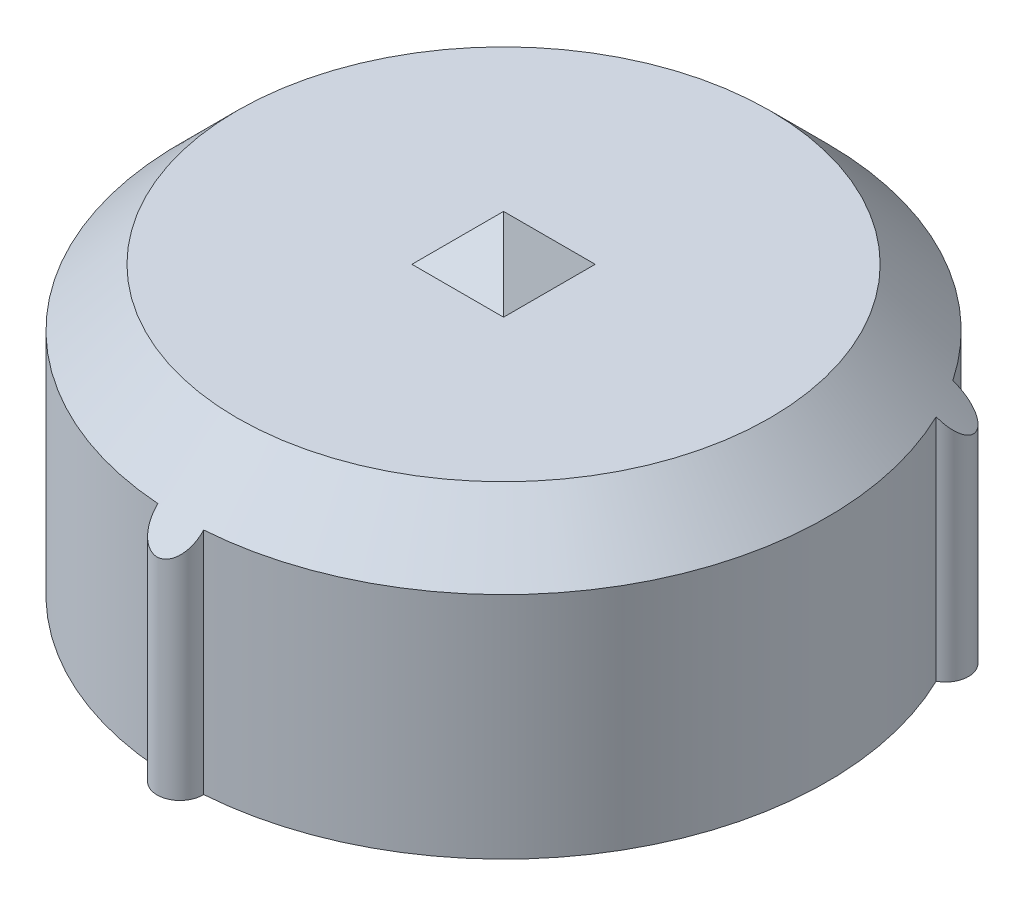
ISO-10303-21;
HEADER;
FILE_DESCRIPTION(('STEP AP214'),'2;1');
FILE_NAME('part.step','',(''),(''),'','','');
FILE_SCHEMA(('AUTOMOTIVE_DESIGN { 1 0 10303 214 1 1 1 1 }'));
ENDSEC;
DATA;
#1=APPLICATION_CONTEXT('core data for automotive mechanical design processes');
#2=APPLICATION_PROTOCOL_DEFINITION('international standard','automotive_design',2000,#1);
#3=PRODUCT_CONTEXT('',#1,'mechanical');
#4=PRODUCT('Part','Part','',(#3));
#5=PRODUCT_RELATED_PRODUCT_CATEGORY('part','',(#4));
#6=PRODUCT_DEFINITION_FORMATION('','',#4);
#7=PRODUCT_DEFINITION_CONTEXT('part definition',#1,'design');
#8=PRODUCT_DEFINITION('design','',#6,#7);
#9=PRODUCT_DEFINITION_SHAPE('','',#8);
#10=(LENGTH_UNIT() NAMED_UNIT(*) SI_UNIT(.MILLI.,.METRE.));
#11=(NAMED_UNIT(*) PLANE_ANGLE_UNIT() SI_UNIT($,.RADIAN.));
#12=(NAMED_UNIT(*) SI_UNIT($,.STERADIAN.) SOLID_ANGLE_UNIT());
#13=UNCERTAINTY_MEASURE_WITH_UNIT(LENGTH_MEASURE(1.E-05),#10,'distance_accuracy_value','');
#14=(GEOMETRIC_REPRESENTATION_CONTEXT(3) GLOBAL_UNCERTAINTY_ASSIGNED_CONTEXT((#13)) GLOBAL_UNIT_ASSIGNED_CONTEXT((#10,
#11,#12)) REPRESENTATION_CONTEXT('',''));
#15=CARTESIAN_POINT('',(0.,0.,0.));
#16=DIRECTION('',(0.,0.,1.));
#17=DIRECTION('',(1.,0.,0.));
#18=AXIS2_PLACEMENT_3D('',#15,#16,#17);
#19=CARTESIAN_POINT('',(6.05,5.,0.));
#20=DIRECTION('',(0.,-1.,0.));
#21=DIRECTION('',(0.,0.,-1.));
#22=AXIS2_PLACEMENT_3D('',#19,#20,#21);
#23=PLANE('',#22);
#24=DIRECTION('',(0.,0.,-1.));
#25=VECTOR('',#24,1.);
#26=CARTESIAN_POINT('',(0.8,5.,0.));
#27=LINE('',#26,#25);
#28=CARTESIAN_POINT('',(0.8,5.,0.799999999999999));
#29=VERTEX_POINT('',#28);
#30=CARTESIAN_POINT('',(0.8,5.,-0.800000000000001));
#31=VERTEX_POINT('',#30);
#32=EDGE_CURVE('E111',#29,#31,#27,.T.);
#33=ORIENTED_EDGE('',*,*,#32,.F.);
#34=DIRECTION('',(1.,0.,0.));
#35=VECTOR('',#34,1.);
#36=CARTESIAN_POINT('',(6.05,5.,0.799999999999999));
#37=LINE('',#36,#35);
#38=CARTESIAN_POINT('',(-0.799999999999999,5.,0.799999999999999));
#39=VERTEX_POINT('',#38);
#40=EDGE_CURVE('E107',#39,#29,#37,.T.);
#41=ORIENTED_EDGE('',*,*,#40,.F.);
#42=DIRECTION('',(0.,0.,1.));
#43=VECTOR('',#42,1.);
#44=CARTESIAN_POINT('',(-0.8,5.,0.));
#45=LINE('',#44,#43);
#46=CARTESIAN_POINT('',(-0.800000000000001,5.,-0.800000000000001));
#47=VERTEX_POINT('',#46);
#48=EDGE_CURVE('E110',#47,#39,#45,.T.);
#49=ORIENTED_EDGE('',*,*,#48,.F.);
#50=DIRECTION('',(-1.,0.,0.));
#51=VECTOR('',#50,1.);
#52=CARTESIAN_POINT('',(6.05,5.,-0.800000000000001));
#53=LINE('',#52,#51);
#54=EDGE_CURVE('E61',#31,#47,#53,.T.);
#55=ORIENTED_EDGE('',*,*,#54,.F.);
#56=EDGE_LOOP('',(#33,#41,#49,#55));
#57=FACE_BOUND('',#56,.T.);
#58=CARTESIAN_POINT('',(0.,5.,0.));
#59=DIRECTION('',(0.,-1.,0.));
#60=DIRECTION('',(0.,0.,-1.));
#61=AXIS2_PLACEMENT_3D('',#58,#59,#60);
#62=CIRCLE('',#61,4.65);
#63=CARTESIAN_POINT('',(0.,5.,-4.65));
#64=VERTEX_POINT('',#63);
#65=EDGE_CURVE('E250',#64,#64,#62,.T.);
#66=ORIENTED_EDGE('',*,*,#65,.F.);
#67=EDGE_LOOP('',(#66));
#68=FACE_BOUND('',#67,.T.);
#69=ADVANCED_FACE('F37',(#57,#68),#23,.F.);
#70=CARTESIAN_POINT('',(0.8,5.,0.));
#71=DIRECTION('',(0.707106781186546,0.707106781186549,0.));
#72=DIRECTION('',(-0.707106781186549,0.707106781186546,0.));
#73=AXIS2_PLACEMENT_3D('',#70,#71,#72);
#74=PLANE('',#73);
#75=DIRECTION('',(0.577350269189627,-0.577350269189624,0.577350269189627));
#76=VECTOR('',#75,1.);
#77=CARTESIAN_POINT('',(0.533333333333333,5.26666666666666,0.533333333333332));
#78=LINE('',#77,#76);
#79=CARTESIAN_POINT('',(0.,5.8,0.));
#80=VERTEX_POINT('',#79);
#81=EDGE_CURVE('E74',#80,#29,#78,.T.);
#82=ORIENTED_EDGE('',*,*,#81,.T.);
#83=ORIENTED_EDGE('',*,*,#32,.T.);
#84=DIRECTION('',(0.577350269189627,-0.577350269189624,-0.577350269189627));
#85=VECTOR('',#84,1.);
#86=CARTESIAN_POINT('',(2.55000000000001,3.25,-2.55));
#87=LINE('',#86,#85);
#88=EDGE_CURVE('E113',#80,#31,#87,.T.);
#89=ORIENTED_EDGE('',*,*,#88,.F.);
#90=EDGE_LOOP('',(#82,#83,#89));
#91=FACE_BOUND('',#90,.T.);
#92=ADVANCED_FACE('F140',(#91),#74,.T.);
#93=CARTESIAN_POINT('',(6.05,5.,-0.800000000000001));
#94=DIRECTION('',(0.,0.707106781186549,-0.707106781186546));
#95=DIRECTION('',(0.,0.707106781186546,0.707106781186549));
#96=AXIS2_PLACEMENT_3D('',#93,#94,#95);
#97=PLANE('',#96);
#98=ORIENTED_EDGE('',*,*,#88,.T.);
#99=ORIENTED_EDGE('',*,*,#54,.T.);
#100=DIRECTION('',(-0.577350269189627,-0.577350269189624,-0.577350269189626));
#101=VECTOR('',#100,1.);
#102=CARTESIAN_POINT('',(-0.533333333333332,5.26666666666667,-0.533333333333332));
#103=LINE('',#102,#101);
#104=EDGE_CURVE('E121',#80,#47,#103,.T.);
#105=ORIENTED_EDGE('',*,*,#104,.F.);
#106=EDGE_LOOP('',(#98,#99,#105));
#107=FACE_BOUND('',#106,.T.);
#108=ADVANCED_FACE('F138',(#107),#97,.T.);
#109=CARTESIAN_POINT('',(-0.8,5.,0.));
#110=DIRECTION('',(-0.707106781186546,0.707106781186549,0.));
#111=DIRECTION('',(-0.707106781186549,-0.707106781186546,0.));
#112=AXIS2_PLACEMENT_3D('',#109,#110,#111);
#113=PLANE('',#112);
#114=ORIENTED_EDGE('',*,*,#104,.T.);
#115=ORIENTED_EDGE('',*,*,#48,.T.);
#116=DIRECTION('',(-0.577350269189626,-0.577350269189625,0.577350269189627));
#117=VECTOR('',#116,1.);
#118=CARTESIAN_POINT('',(1.48333333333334,7.28333333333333,-1.48333333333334));
#119=LINE('',#118,#117);
#120=EDGE_CURVE('E119',#80,#39,#119,.T.);
#121=ORIENTED_EDGE('',*,*,#120,.F.);
#122=EDGE_LOOP('',(#114,#115,#121));
#123=FACE_BOUND('',#122,.T.);
#124=ADVANCED_FACE('F118',(#123),#113,.T.);
#125=CARTESIAN_POINT('',(6.05,5.,0.799999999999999));
#126=DIRECTION('',(0.,0.707106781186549,0.707106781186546));
#127=DIRECTION('',(0.,-0.707106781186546,0.707106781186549));
#128=AXIS2_PLACEMENT_3D('',#125,#126,#127);
#129=PLANE('',#128);
#130=ORIENTED_EDGE('',*,*,#120,.T.);
#131=ORIENTED_EDGE('',*,*,#40,.T.);
#132=ORIENTED_EDGE('',*,*,#81,.F.);
#133=EDGE_LOOP('',(#130,#131,#132));
#134=FACE_BOUND('',#133,.T.);
#135=ADVANCED_FACE('F39',(#134),#129,.T.);
#136=CARTESIAN_POINT('',(0.,1.,0.));
#137=DIRECTION('',(0.,-1.,0.));
#138=DIRECTION('',(0.,0.,-1.));
#139=AXIS2_PLACEMENT_3D('',#136,#137,#138);
#140=CONICAL_SURFACE('',#139,8.65000000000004,0.785398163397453);
#141=ORIENTED_EDGE('',*,*,#65,.T.);
#142=EDGE_LOOP('',(#141));
#143=FACE_BOUND('',#142,.T.);
#144=CARTESIAN_POINT('',(-0.399742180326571,4.00020000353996,5.6356407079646));
#145=CARTESIAN_POINT('',(-0.400281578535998,3.98502719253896,5.65081283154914));
#146=CARTESIAN_POINT('',(-0.399968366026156,3.96987927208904,5.66602162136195));
#147=CARTESIAN_POINT('',(-0.397588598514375,3.9396908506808,5.6964515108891));
#148=CARTESIAN_POINT('',(-0.395519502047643,3.92465053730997,5.71167259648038));
#149=CARTESIAN_POINT('',(-0.3865573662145,3.87959302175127,5.75745093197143));
#150=CARTESIAN_POINT('',(-0.376898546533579,3.84989716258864,5.78786525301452));
#151=CARTESIAN_POINT('',(-0.353673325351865,3.80104808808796,5.83825900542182));
#152=CARTESIAN_POINT('',(-0.34210410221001,3.78137189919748,5.85866688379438));
#153=CARTESIAN_POINT('',(-0.314743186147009,3.74361875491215,5.89800767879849));
#154=CARTESIAN_POINT('',(-0.298966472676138,3.72553642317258,5.91694552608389));
#155=CARTESIAN_POINT('',(-0.267315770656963,3.6958371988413,5.94817608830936));
#156=CARTESIAN_POINT('',(-0.252402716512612,3.68371865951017,5.96096342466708));
#157=CARTESIAN_POINT('',(-0.219957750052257,3.66128680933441,5.98469561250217));
#158=CARTESIAN_POINT('',(-0.202428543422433,3.65097165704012,5.99564234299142));
#159=CARTESIAN_POINT('',(-0.168542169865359,3.63450034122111,6.01315766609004));
#160=CARTESIAN_POINT('',(-0.152616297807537,3.6279255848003,6.02016360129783));
#161=CARTESIAN_POINT('',(-0.119390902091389,3.61666761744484,6.03217414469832));
#162=CARTESIAN_POINT('',(-0.102092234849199,3.6119832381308,6.03717998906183));
#163=CARTESIAN_POINT('',(-0.0664171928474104,3.60479018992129,6.04487153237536));
#164=CARTESIAN_POINT('',(-0.0480345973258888,3.60229572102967,6.04754208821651));
#165=CARTESIAN_POINT('',(-0.0109101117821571,3.59973518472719,6.0502834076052));
#166=CARTESIAN_POINT('',(0.0078316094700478,3.59966800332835,6.05035536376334));
#167=CARTESIAN_POINT('',(0.0430114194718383,3.60184024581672,6.04802970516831));
#168=CARTESIAN_POINT('',(0.0594832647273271,3.60383613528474,6.04589283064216));
#169=CARTESIAN_POINT('',(0.0917237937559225,3.60963768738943,6.03968748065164));
#170=CARTESIAN_POINT('',(0.107492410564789,3.61344352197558,6.0356188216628));
#171=CARTESIAN_POINT('',(0.138454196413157,3.6227932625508,6.02563705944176));
#172=CARTESIAN_POINT('',(0.153615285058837,3.62838650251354,6.01967163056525));
#173=CARTESIAN_POINT('',(0.182613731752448,3.6410008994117,6.0062416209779));
#174=CARTESIAN_POINT('',(0.196450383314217,3.64802281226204,5.99877624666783));
#175=CARTESIAN_POINT('',(0.229023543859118,3.66690910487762,5.97873898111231));
#176=CARTESIAN_POINT('',(0.246907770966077,3.67947632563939,5.96543999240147));
#177=CARTESIAN_POINT('',(0.279496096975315,3.70647785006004,5.9369709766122));
#178=CARTESIAN_POINT('',(0.294193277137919,3.72091610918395,5.92179698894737));
#179=CARTESIAN_POINT('',(0.32521968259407,3.75650643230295,5.88454416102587));
#180=CARTESIAN_POINT('',(0.340264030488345,3.77821746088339,5.86193170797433));
#181=CARTESIAN_POINT('',(0.365164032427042,3.82317330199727,5.81538944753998));
#182=CARTESIAN_POINT('',(0.37500855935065,3.84642128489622,5.79145693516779));
#183=CARTESIAN_POINT('',(0.389109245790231,3.8913830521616,5.74546175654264));
#184=CARTESIAN_POINT('',(0.39383132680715,3.91301294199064,5.72345596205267));
#185=CARTESIAN_POINT('',(0.399519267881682,3.95649040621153,5.67947562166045));
#186=CARTESIAN_POINT('',(0.40051113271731,3.97833540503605,5.65750193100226));
#187=CARTESIAN_POINT('',(0.399742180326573,4.00020000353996,5.6356407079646));
#188=B_SPLINE_CURVE_WITH_KNOTS('',3,(#144,#145,#146,#147,#148,#149,#150,#151,#152,#153,#154,
#155,#156,#157,#158,#159,#160,#161,#162,#163,#164,#165,#166,#167,#168,#169,#170,#171,#172,#173,
#174,#175,#176,#177,#178,#179,#180,#181,#182,#183,#184,#185,#186,#187),.UNSPECIFIED.,.F.,.F.,(4,
2,2,2,2,2,2,2,2,2,2,2,2,2,2,2,2,2,2,2,2,4),(0.,0.0643461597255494,0.128785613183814,
0.258746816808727,0.350316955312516,0.441565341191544,0.510573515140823,0.5795108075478,
0.635087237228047,0.690629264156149,0.746528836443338,0.802402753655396,0.852359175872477,
0.902320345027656,0.953800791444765,1.00530854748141,1.08163954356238,1.15813462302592,
1.26188985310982,1.36586621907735,1.45928542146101,1.55205214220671),.UNSPECIFIED.);
#189=CARTESIAN_POINT('',(-0.399749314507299,4.00000000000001,5.6358407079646));
#190=VERTEX_POINT('',#189);
#191=CARTESIAN_POINT('',(0.3997493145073,4.00000000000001,5.6358407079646));
#192=VERTEX_POINT('',#191);
#193=EDGE_CURVE('E130',#190,#192,#188,.T.);
#194=ORIENTED_EDGE('',*,*,#193,.T.);
#195=CARTESIAN_POINT('',(0.,4.00000000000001,0.));
#196=DIRECTION('',(0.,-1.,0.));
#197=DIRECTION('',(0.,0.,-1.));
#198=AXIS2_PLACEMENT_3D('',#195,#196,#197);
#199=CIRCLE('',#198,5.65);
#200=CARTESIAN_POINT('',(5.0806558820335,4.00000000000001,-2.47172729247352));
#201=VERTEX_POINT('',#200);
#202=EDGE_CURVE('E214',#192,#201,#199,.F.);
#203=ORIENTED_EDGE('',*,*,#202,.T.);
#204=CARTESIAN_POINT('',(4.61783399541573,4.38224711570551,-2.53472476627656));
#205=CARTESIAN_POINT('',(4.6335834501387,4.37562432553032,-2.5197937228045));
#206=CARTESIAN_POINT('',(4.65007364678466,4.36740282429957,-2.50658664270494));
#207=CARTESIAN_POINT('',(4.68372834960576,4.34859119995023,-2.48353587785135));
#208=CARTESIAN_POINT('',(4.7008833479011,4.33802836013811,-2.47365651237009));
#209=CARTESIAN_POINT('',(4.73575420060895,4.31497422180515,-2.45670107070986));
#210=CARTESIAN_POINT('',(4.75347457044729,4.30245109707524,-2.44967975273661));
#211=CARTESIAN_POINT('',(4.78889343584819,4.27609345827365,-2.43834844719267));
#212=CARTESIAN_POINT('',(4.80659158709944,4.26225410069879,-2.43404895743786));
#213=CARTESIAN_POINT('',(4.85015756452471,4.22677859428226,-2.42642820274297));
#214=CARTESIAN_POINT('',(4.87584458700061,4.20460389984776,-2.42458127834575));
#215=CARTESIAN_POINT('',(4.92606031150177,4.15915558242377,-2.42557511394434));
#216=CARTESIAN_POINT('',(4.95058934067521,4.13588227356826,-2.42841454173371));
#217=CARTESIAN_POINT('',(4.99302085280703,4.09389319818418,-2.43722927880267));
#218=CARTESIAN_POINT('',(5.0112056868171,4.07528513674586,-2.44238978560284));
#219=CARTESIAN_POINT('',(5.04654953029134,4.03792194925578,-2.45514997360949));
#220=CARTESIAN_POINT('',(5.06370807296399,4.01916676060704,-2.46275075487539));
#221=CARTESIAN_POINT('',(5.10724371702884,3.96993138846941,-2.48580902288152));
#222=CARTESIAN_POINT('',(5.13265210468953,3.93947593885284,-2.50320413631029));
#223=CARTESIAN_POINT('',(5.17945502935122,3.87948206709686,-2.54404974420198));
#224=CARTESIAN_POINT('',(5.20084890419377,3.84994379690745,-2.56750123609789));
#225=CARTESIAN_POINT('',(5.23279848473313,3.80123796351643,-2.61265235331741));
#226=CARTESIAN_POINT('',(5.24469418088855,3.78156330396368,-2.63285944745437));
#227=CARTESIAN_POINT('',(5.26511713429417,3.74378108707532,-2.67622529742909));
#228=CARTESIAN_POINT('',(5.27365052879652,3.72567072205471,-2.6993785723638));
#229=CARTESIAN_POINT('',(5.28489751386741,3.69593591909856,-2.74243307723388));
#230=CARTESIAN_POINT('',(5.28852371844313,3.68380802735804,-2.76174630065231));
#231=CARTESIAN_POINT('',(5.29286915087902,3.66136056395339,-2.8017165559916));
#232=CARTESIAN_POINT('',(5.29359205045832,3.65103872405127,-2.82237185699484));
#233=CARTESIAN_POINT('',(5.29183066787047,3.63455475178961,-2.86047987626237));
#234=CARTESIAN_POINT('',(5.2899407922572,3.6279741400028,-2.87777746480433));
#235=CARTESIAN_POINT('',(5.28374041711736,3.61670431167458,-2.91256305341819));
#236=CARTESIAN_POINT('',(5.27943138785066,3.61201394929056,-2.93005093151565));
#237=CARTESIAN_POINT('',(5.26826415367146,3.60480922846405,-2.96480113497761));
#238=CARTESIAN_POINT('',(5.26138972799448,3.60230906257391,-2.98206128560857));
#239=CARTESIAN_POINT('',(5.2452081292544,3.59973791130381,-3.01559399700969));
#240=CARTESIAN_POINT('',(5.23590204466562,3.59966584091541,-3.0318669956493));
#241=CARTESIAN_POINT('',(5.21630250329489,3.60182986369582,-3.06118067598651));
#242=CARTESIAN_POINT('',(5.20621840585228,3.60382199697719,-3.07438112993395));
#243=CARTESIAN_POINT('',(5.18472816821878,3.60961660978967,-3.09920742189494));
#244=CARTESIAN_POINT('',(5.17332191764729,3.61341924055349,-3.11083312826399));
#245=CARTESIAN_POINT('',(5.14920096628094,3.622762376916,-3.13266232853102));
#246=CARTESIAN_POINT('',(5.13645712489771,3.62835196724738,-3.14281217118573));
#247=CARTESIAN_POINT('',(5.11033253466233,3.64095927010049,-3.16121620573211));
#248=CARTESIAN_POINT('',(5.09695145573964,3.64797772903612,-3.16946940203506));
#249=CARTESIAN_POINT('',(5.0633219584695,3.666853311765,-3.18766526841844));
#250=CARTESIAN_POINT('',(5.04286986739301,3.67941286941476,-3.19650730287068));
#251=CARTESIAN_POINT('',(5.00193108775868,3.70640110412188,-3.21050467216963));
#252=CARTESIAN_POINT('',(4.98144442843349,3.72083403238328,-3.21565144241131));
#253=CARTESIAN_POINT('',(4.93366086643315,3.75642320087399,-3.22391061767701));
#254=CARTESIAN_POINT('',(4.90654436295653,3.77813990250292,-3.22564032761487));
#255=CARTESIAN_POINT('',(4.85379731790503,3.82308133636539,-3.22394530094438));
#256=CARTESIAN_POINT('',(4.82816815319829,3.84630742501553,-3.22051586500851));
#257=CARTESIAN_POINT('',(4.78133456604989,3.8912126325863,-3.20975637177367));
#258=CARTESIAN_POINT('',(4.75994559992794,3.91280736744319,-3.20286062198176));
#259=CARTESIAN_POINT('',(4.71894329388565,3.95633948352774,-3.18580661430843));
#260=CARTESIAN_POINT('',(4.6993278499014,3.97827642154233,-3.17565228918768));
#261=CARTESIAN_POINT('',(4.67002930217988,4.01282710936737,-3.15730015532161));
#262=CARTESIAN_POINT('',(4.65967889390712,4.02542579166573,-3.15011572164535));
#263=CARTESIAN_POINT('',(4.63968303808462,4.05057729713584,-3.13478478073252));
#264=CARTESIAN_POINT('',(4.63003704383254,4.06313014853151,-3.12663903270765));
#265=CARTESIAN_POINT('',(4.6207607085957,4.07563971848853,-3.11802229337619));
#266=B_SPLINE_CURVE_WITH_KNOTS('',3,(#204,#205,#206,#207,#208,#209,#210,#211,#212,#213,#214,
#215,#216,#217,#218,#219,#220,#221,#222,#223,#224,#225,#226,#227,#228,#229,#230,#231,#232,#233,
#234,#235,#236,#237,#238,#239,#240,#241,#242,#243,#244,#245,#246,#247,#248,#249,#250,#251,#252,
#253,#254,#255,#256,#257,#258,#259,#260,#261,#262,#263,#264,#265),.UNSPECIFIED.,.F.,.F.,(4,2,2,
2,2,2,2,2,2,2,2,2,2,2,2,2,2,2,2,2,2,2,2,2,2,2,2,2,2,2,4),(0.,0.0677177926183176,
0.134684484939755,0.202879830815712,0.271336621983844,0.372842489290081,0.474319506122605,
0.553761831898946,0.633240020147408,0.762571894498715,0.891925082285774,0.983458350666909,
1.07482375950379,1.14386139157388,1.21281168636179,1.26839927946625,1.32395312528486,
1.37986435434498,1.43575059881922,1.48571035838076,1.53567429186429,1.58714942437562,
1.63865151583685,1.71495744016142,1.79143965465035,1.8952323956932,1.9991197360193,
2.09239331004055,2.1855547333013,2.23897260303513,2.29234856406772),.UNSPECIFIED.);
#267=CARTESIAN_POINT('',(4.6809065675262,4.00000000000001,-3.164113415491));
#268=VERTEX_POINT('',#267);
#269=EDGE_CURVE('E52',#201,#268,#266,.T.);
#270=ORIENTED_EDGE('',*,*,#269,.T.);
#271=CARTESIAN_POINT('',(0.,4.00000000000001,0.));
#272=DIRECTION('',(0.,-1.,0.));
#273=DIRECTION('',(0.,0.,-1.));
#274=AXIS2_PLACEMENT_3D('',#271,#272,#273);
#275=CIRCLE('',#274,5.65);
#276=CARTESIAN_POINT('',(-4.68090656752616,4.00000000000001,-3.16411341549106));
#277=VERTEX_POINT('',#276);
#278=EDGE_CURVE('E11',#268,#277,#275,.F.);
#279=ORIENTED_EDGE('',*,*,#278,.T.);
#280=CARTESIAN_POINT('',(-4.62076070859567,4.07563971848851,-3.11802229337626));
#281=CARTESIAN_POINT('',(-4.63234286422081,4.0600228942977,-3.12877641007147));
#282=CARTESIAN_POINT('',(-4.64449392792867,4.04434471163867,-3.13879697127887));
#283=CARTESIAN_POINT('',(-4.66987007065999,4.01294364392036,-3.15732790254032));
#284=CARTESIAN_POINT('',(-4.68309587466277,3.99722073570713,-3.16583724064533));
#285=CARTESIAN_POINT('',(-4.72444917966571,3.94992318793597,-3.18911706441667));
#286=CARTESIAN_POINT('',(-4.75409489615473,3.91843222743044,-3.20149318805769));
#287=CARTESIAN_POINT('',(-4.81010151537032,3.86319936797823,-3.21714873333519));
#288=CARTESIAN_POINT('',(-4.83585238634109,3.83921442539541,-3.22178945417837));
#289=CARTESIAN_POINT('',(-4.88897110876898,3.79269263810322,-3.22586133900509));
#290=CARTESIAN_POINT('',(-4.91633382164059,3.77015162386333,-3.22530825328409));
#291=CARTESIAN_POINT('',(-4.96443831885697,3.73323426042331,-3.21910582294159));
#292=CARTESIAN_POINT('',(-4.98494488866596,3.71831061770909,-3.2148911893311));
#293=CARTESIAN_POINT('',(-5.02608659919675,3.69018267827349,-3.20283272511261));
#294=CARTESIAN_POINT('',(-5.04672154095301,3.67697619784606,-3.19499356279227));
#295=CARTESIAN_POINT('',(-5.08305438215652,3.65556041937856,-3.1774343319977));
#296=CARTESIAN_POINT('',(-5.09885251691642,3.64688850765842,-3.16849080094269));
#297=CARTESIAN_POINT('',(-5.12968885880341,3.63140845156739,-3.14801814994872));
#298=CARTESIAN_POINT('',(-5.14472740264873,3.6245994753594,-3.13649018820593));
#299=CARTESIAN_POINT('',(-5.17360324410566,3.61322093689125,-3.11076753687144));
#300=CARTESIAN_POINT('',(-5.18742809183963,3.60867275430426,-3.09654908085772));
#301=CARTESIAN_POINT('',(-5.21303247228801,3.60229706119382,-3.06584257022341));
#302=CARTESIAN_POINT('',(-5.22481428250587,3.60046650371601,-3.04935708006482));
#303=CARTESIAN_POINT('',(-5.24419470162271,3.59974806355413,-3.01732793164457));
#304=CARTESIAN_POINT('',(-5.25215496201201,3.60046263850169,-3.00200947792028));
#305=CARTESIAN_POINT('',(-5.26596780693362,3.60392502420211,-2.9706726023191));
#306=CARTESIAN_POINT('',(-5.27182051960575,3.6066727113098,-2.95465422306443));
#307=CARTESIAN_POINT('',(-5.28122901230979,3.61391570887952,-2.92287330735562));
#308=CARTESIAN_POINT('',(-5.28484554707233,3.61835893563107,-2.90711650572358));
#309=CARTESIAN_POINT('',(-5.29012519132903,3.62875989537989,-2.87578400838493));
#310=CARTESIAN_POINT('',(-5.29178750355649,3.63471824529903,-2.86020838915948));
#311=CARTESIAN_POINT('',(-5.29362471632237,3.65060457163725,-2.82323672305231));
#312=CARTESIAN_POINT('',(-5.29291348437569,3.66115949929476,-2.80206491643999));
#313=CARTESIAN_POINT('',(-5.28844886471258,3.68416643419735,-2.76111788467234));
#314=CARTESIAN_POINT('',(-5.28468928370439,3.69662226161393,-2.74134559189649));
#315=CARTESIAN_POINT('',(-5.27286439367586,3.72755236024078,-2.69678973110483));
#316=CARTESIAN_POINT('',(-5.26375030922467,3.74660347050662,-2.6726866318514));
#317=CARTESIAN_POINT('',(-5.24190971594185,3.78635719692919,-2.62772109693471));
#318=CARTESIAN_POINT('',(-5.2291779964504,3.80706216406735,-2.60686340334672));
#319=CARTESIAN_POINT('',(-5.19650067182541,3.8560369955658,-2.56253677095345));
#320=CARTESIAN_POINT('',(-5.17554012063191,3.8846798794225,-2.54022799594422));
#321=CARTESIAN_POINT('',(-5.1298862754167,3.94281315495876,-2.50126016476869));
#322=CARTESIAN_POINT('',(-5.10518927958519,3.97230436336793,-2.48460676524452));
#323=CARTESIAN_POINT('',(-5.05253238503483,4.03175299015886,-2.45695279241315));
#324=CARTESIAN_POINT('',(-5.02453593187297,4.06171166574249,-2.4460246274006));
#325=CARTESIAN_POINT('',(-4.96614140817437,4.1209644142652,-2.43057843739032));
#326=CARTESIAN_POINT('',(-4.9357446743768,4.1502588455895,-2.42605687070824));
#327=CARTESIAN_POINT('',(-4.88151547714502,4.19955595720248,-2.4245073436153));
#328=CARTESIAN_POINT('',(-4.85808854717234,4.21995691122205,-2.42580554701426));
#329=CARTESIAN_POINT('',(-4.81063678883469,4.25919366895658,-2.43284987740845));
#330=CARTESIAN_POINT('',(-4.78661421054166,4.27803445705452,-2.43858118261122));
#331=CARTESIAN_POINT('',(-4.75308842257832,4.30256806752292,-2.45014900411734));
#332=CARTESIAN_POINT('',(-4.74359148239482,4.30932078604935,-2.45382521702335));
#333=CARTESIAN_POINT('',(-4.72464673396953,4.32235489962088,-2.46202758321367));
#334=CARTESIAN_POINT('',(-4.71519889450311,4.32863664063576,-2.46655310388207));
#335=CARTESIAN_POINT('',(-4.69738414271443,4.34002072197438,-2.47598952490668));
#336=CARTESIAN_POINT('',(-4.68900606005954,4.34517790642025,-2.48081282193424));
#337=CARTESIAN_POINT('',(-4.65901877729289,4.36285016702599,-2.49959741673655));
#338=CARTESIAN_POINT('',(-4.63786764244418,4.37381435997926,-2.51574826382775));
#339=CARTESIAN_POINT('',(-4.61783399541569,4.38224711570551,-2.53472476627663));
#340=B_SPLINE_CURVE_WITH_KNOTS('',3,(#280,#281,#282,#283,#284,#285,#286,#287,#288,#289,#290,
#291,#292,#293,#294,#295,#296,#297,#298,#299,#300,#301,#302,#303,#304,#305,#306,#307,#308,#309,
#310,#311,#312,#313,#314,#315,#316,#317,#318,#319,#320,#321,#322,#323,#324,#325,#326,#327,#328,
#329,#330,#331,#332,#333,#334,#335,#336,#337,#338,#339),.UNSPECIFIED.,.F.,.F.,(4,2,2,2,2,2,2,2,
2,2,2,2,2,2,2,2,2,2,2,2,2,2,2,2,2,2,2,2,2,4),(0.,0.0666070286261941,0.133259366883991,
0.267460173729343,0.37358939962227,0.479396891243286,0.556275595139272,0.633055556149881,
0.693185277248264,0.753288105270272,0.813948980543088,0.874541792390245,0.926113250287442,
0.977681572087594,1.02777898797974,1.07789683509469,1.14850773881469,1.21926246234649,
1.31487967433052,1.41063531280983,1.5357503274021,1.66099011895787,1.78777777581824,
1.91449531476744,2.00749440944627,2.10018390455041,2.13681140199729,2.1734117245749,
2.20624504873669,2.29204333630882),.UNSPECIFIED.);
#341=CARTESIAN_POINT('',(-5.08065588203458,4.00000000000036,-2.47172729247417));
#342=VERTEX_POINT('',#341);
#343=EDGE_CURVE('E219',#277,#342,#340,.T.);
#344=ORIENTED_EDGE('',*,*,#343,.T.);
#345=CARTESIAN_POINT('',(0.,4.00000000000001,0.));
#346=DIRECTION('',(0.,-1.,0.));
#347=DIRECTION('',(0.,0.,-1.));
#348=AXIS2_PLACEMENT_3D('',#345,#346,#347);
#349=CIRCLE('',#348,5.65);
#350=EDGE_CURVE('E84',#342,#190,#349,.F.);
#351=ORIENTED_EDGE('',*,*,#350,.T.);
#352=EDGE_LOOP('',(#194,#203,#270,#279,#344,#351));
#353=FACE_BOUND('',#352,.T.);
#354=ADVANCED_FACE('F236',(#143,#353),#140,.T.);
#355=CARTESIAN_POINT('',(0.,0.,0.));
#356=DIRECTION('',(0.,1.,0.));
#357=DIRECTION('',(0.,0.,1.));
#358=AXIS2_PLACEMENT_3D('',#355,#356,#357);
#359=PLANE('',#358);
#360=CARTESIAN_POINT('',(0.,0.,0.));
#361=DIRECTION('',(0.,1.,0.));
#362=DIRECTION('',(0.,0.,1.));
#363=AXIS2_PLACEMENT_3D('',#360,#361,#362);
#364=CIRCLE('',#363,5.65);
#365=CARTESIAN_POINT('',(0.3997493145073,0.,5.6358407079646));
#366=VERTEX_POINT('',#365);
#367=CARTESIAN_POINT('',(5.08065588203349,0.,-2.47172729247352));
#368=VERTEX_POINT('',#367);
#369=EDGE_CURVE('E155',#366,#368,#364,.T.);
#370=ORIENTED_EDGE('',*,*,#369,.F.);
#371=CARTESIAN_POINT('',(0.,0.,5.65));
#372=DIRECTION('',(0.,1.,0.));
#373=DIRECTION('',(0.,0.,1.));
#374=AXIS2_PLACEMENT_3D('',#371,#372,#373);
#375=CIRCLE('',#374,0.399999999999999);
#376=CARTESIAN_POINT('',(-0.399749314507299,0.,5.6358407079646));
#377=VERTEX_POINT('',#376);
#378=EDGE_CURVE('E147',#377,#366,#375,.T.);
#379=ORIENTED_EDGE('',*,*,#378,.F.);
#380=CARTESIAN_POINT('',(0.,0.,0.));
#381=DIRECTION('',(0.,1.,0.));
#382=DIRECTION('',(0.,0.,1.));
#383=AXIS2_PLACEMENT_3D('',#380,#381,#382);
#384=CIRCLE('',#383,5.65);
#385=CARTESIAN_POINT('',(-5.08065588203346,0.,-2.47172729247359));
#386=VERTEX_POINT('',#385);
#387=EDGE_CURVE('E142',#386,#377,#384,.T.);
#388=ORIENTED_EDGE('',*,*,#387,.F.);
#389=CARTESIAN_POINT('',(-4.89304353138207,0.,-2.82500000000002));
#390=DIRECTION('',(0.,1.,0.));
#391=DIRECTION('',(0.,0.,1.));
#392=AXIS2_PLACEMENT_3D('',#389,#390,#391);
#393=CIRCLE('',#392,0.399999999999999);
#394=CARTESIAN_POINT('',(-4.68090656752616,0.,-3.16411341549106));
#395=VERTEX_POINT('',#394);
#396=EDGE_CURVE('E165',#395,#386,#393,.T.);
#397=ORIENTED_EDGE('',*,*,#396,.F.);
#398=CARTESIAN_POINT('',(0.,0.,0.));
#399=DIRECTION('',(0.,1.,0.));
#400=DIRECTION('',(0.,0.,1.));
#401=AXIS2_PLACEMENT_3D('',#398,#399,#400);
#402=CIRCLE('',#401,5.65);
#403=CARTESIAN_POINT('',(4.6809065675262,0.,-3.164113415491));
#404=VERTEX_POINT('',#403);
#405=EDGE_CURVE('E161',#404,#395,#402,.T.);
#406=ORIENTED_EDGE('',*,*,#405,.F.);
#407=CARTESIAN_POINT('',(4.8930435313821,0.,-2.82499999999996));
#408=DIRECTION('',(0.,1.,0.));
#409=DIRECTION('',(0.,0.,1.));
#410=AXIS2_PLACEMENT_3D('',#407,#408,#409);
#411=CIRCLE('',#410,0.4);
#412=EDGE_CURVE('E158',#368,#404,#411,.T.);
#413=ORIENTED_EDGE('',*,*,#412,.F.);
#414=EDGE_LOOP('',(#370,#379,#388,#397,#406,#413));
#415=FACE_BOUND('',#414,.T.);
#416=ADVANCED_FACE('F193',(#415),#359,.F.);
#417=CARTESIAN_POINT('',(0.,5.,0.));
#418=DIRECTION('',(0.,-1.,0.));
#419=DIRECTION('',(0.,0.,-1.));
#420=AXIS2_PLACEMENT_3D('',#417,#418,#419);
#421=CYLINDRICAL_SURFACE('',#420,5.65);
#422=ORIENTED_EDGE('',*,*,#350,.F.);
#423=DIRECTION('',(0.,-1.,0.));
#424=VECTOR('',#423,1.);
#425=CARTESIAN_POINT('',(-5.08065588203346,5.,-2.47172729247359));
#426=LINE('',#425,#424);
#427=EDGE_CURVE('E169',#342,#386,#426,.T.);
#428=ORIENTED_EDGE('',*,*,#427,.T.);
#429=ORIENTED_EDGE('',*,*,#387,.T.);
#430=DIRECTION('',(0.,-1.,0.));
#431=VECTOR('',#430,1.);
#432=CARTESIAN_POINT('',(-0.399749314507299,5.,5.6358407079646));
#433=LINE('',#432,#431);
#434=EDGE_CURVE('E46',#190,#377,#433,.T.);
#435=ORIENTED_EDGE('',*,*,#434,.F.);
#436=EDGE_LOOP('',(#422,#428,#429,#435));
#437=FACE_BOUND('',#436,.T.);
#438=ADVANCED_FACE('F196',(#437),#421,.T.);
#439=CARTESIAN_POINT('',(0.,5.,0.));
#440=DIRECTION('',(0.,-1.,0.));
#441=DIRECTION('',(0.,0.,-1.));
#442=AXIS2_PLACEMENT_3D('',#439,#440,#441);
#443=CYLINDRICAL_SURFACE('',#442,5.65);
#444=ORIENTED_EDGE('',*,*,#278,.F.);
#445=DIRECTION('',(0.,-1.,0.));
#446=VECTOR('',#445,1.);
#447=CARTESIAN_POINT('',(4.6809065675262,5.,-3.164113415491));
#448=LINE('',#447,#446);
#449=EDGE_CURVE('E175',#268,#404,#448,.T.);
#450=ORIENTED_EDGE('',*,*,#449,.T.);
#451=ORIENTED_EDGE('',*,*,#405,.T.);
#452=DIRECTION('',(0.,-1.,0.));
#453=VECTOR('',#452,1.);
#454=CARTESIAN_POINT('',(-4.68090656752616,5.,-3.16411341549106));
#455=LINE('',#454,#453);
#456=EDGE_CURVE('E172',#277,#395,#455,.T.);
#457=ORIENTED_EDGE('',*,*,#456,.F.);
#458=EDGE_LOOP('',(#444,#450,#451,#457));
#459=FACE_BOUND('',#458,.T.);
#460=ADVANCED_FACE('F205',(#459),#443,.T.);
#461=CARTESIAN_POINT('',(-4.89304353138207,5.,-2.82500000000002));
#462=DIRECTION('',(0.,-1.,0.));
#463=DIRECTION('',(0.,0.,-1.));
#464=AXIS2_PLACEMENT_3D('',#461,#462,#463);
#465=CYLINDRICAL_SURFACE('',#464,0.399999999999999);
#466=ORIENTED_EDGE('',*,*,#343,.F.);
#467=ORIENTED_EDGE('',*,*,#456,.T.);
#468=ORIENTED_EDGE('',*,*,#396,.T.);
#469=ORIENTED_EDGE('',*,*,#427,.F.);
#470=EDGE_LOOP('',(#466,#467,#468,#469));
#471=FACE_BOUND('',#470,.T.);
#472=ADVANCED_FACE('F201',(#471),#465,.T.);
#473=CARTESIAN_POINT('',(0.,5.,0.));
#474=DIRECTION('',(0.,-1.,0.));
#475=DIRECTION('',(0.,0.,-1.));
#476=AXIS2_PLACEMENT_3D('',#473,#474,#475);
#477=CYLINDRICAL_SURFACE('',#476,5.65);
#478=ORIENTED_EDGE('',*,*,#202,.F.);
#479=DIRECTION('',(0.,-1.,0.));
#480=VECTOR('',#479,1.);
#481=CARTESIAN_POINT('',(0.3997493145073,5.,5.6358407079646));
#482=LINE('',#481,#480);
#483=EDGE_CURVE('E180',#192,#366,#482,.T.);
#484=ORIENTED_EDGE('',*,*,#483,.T.);
#485=ORIENTED_EDGE('',*,*,#369,.T.);
#486=DIRECTION('',(0.,-1.,0.));
#487=VECTOR('',#486,1.);
#488=CARTESIAN_POINT('',(5.08065588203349,5.,-2.47172729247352));
#489=LINE('',#488,#487);
#490=EDGE_CURVE('E178',#201,#368,#489,.T.);
#491=ORIENTED_EDGE('',*,*,#490,.F.);
#492=EDGE_LOOP('',(#478,#484,#485,#491));
#493=FACE_BOUND('',#492,.T.);
#494=ADVANCED_FACE('F213',(#493),#477,.T.);
#495=CARTESIAN_POINT('',(4.8930435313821,5.,-2.82499999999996));
#496=DIRECTION('',(0.,-1.,0.));
#497=DIRECTION('',(0.,0.,-1.));
#498=AXIS2_PLACEMENT_3D('',#495,#496,#497);
#499=CYLINDRICAL_SURFACE('',#498,0.4);
#500=ORIENTED_EDGE('',*,*,#269,.F.);
#501=ORIENTED_EDGE('',*,*,#490,.T.);
#502=ORIENTED_EDGE('',*,*,#412,.T.);
#503=ORIENTED_EDGE('',*,*,#449,.F.);
#504=EDGE_LOOP('',(#500,#501,#502,#503));
#505=FACE_BOUND('',#504,.T.);
#506=ADVANCED_FACE('F209',(#505),#499,.T.);
#507=CARTESIAN_POINT('',(0.,5.,5.65));
#508=DIRECTION('',(0.,-1.,0.));
#509=DIRECTION('',(0.,0.,-1.));
#510=AXIS2_PLACEMENT_3D('',#507,#508,#509);
#511=CYLINDRICAL_SURFACE('',#510,0.399999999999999);
#512=ORIENTED_EDGE('',*,*,#193,.F.);
#513=ORIENTED_EDGE('',*,*,#434,.T.);
#514=ORIENTED_EDGE('',*,*,#378,.T.);
#515=ORIENTED_EDGE('',*,*,#483,.F.);
#516=EDGE_LOOP('',(#512,#513,#514,#515));
#517=FACE_BOUND('',#516,.T.);
#518=ADVANCED_FACE('F187',(#517),#511,.T.);
#519=CLOSED_SHELL('',(#69,#92,#108,#124,#135,#354,#416,#438,#460,#472,#494,#506,#518));
#520=MANIFOLD_SOLID_BREP('B2',#519);
#521=ADVANCED_BREP_SHAPE_REPRESENTATION('',(#18,#520),#14);
#522=SHAPE_DEFINITION_REPRESENTATION(#9,#521);
ENDSEC;
END-ISO-10303-21;
